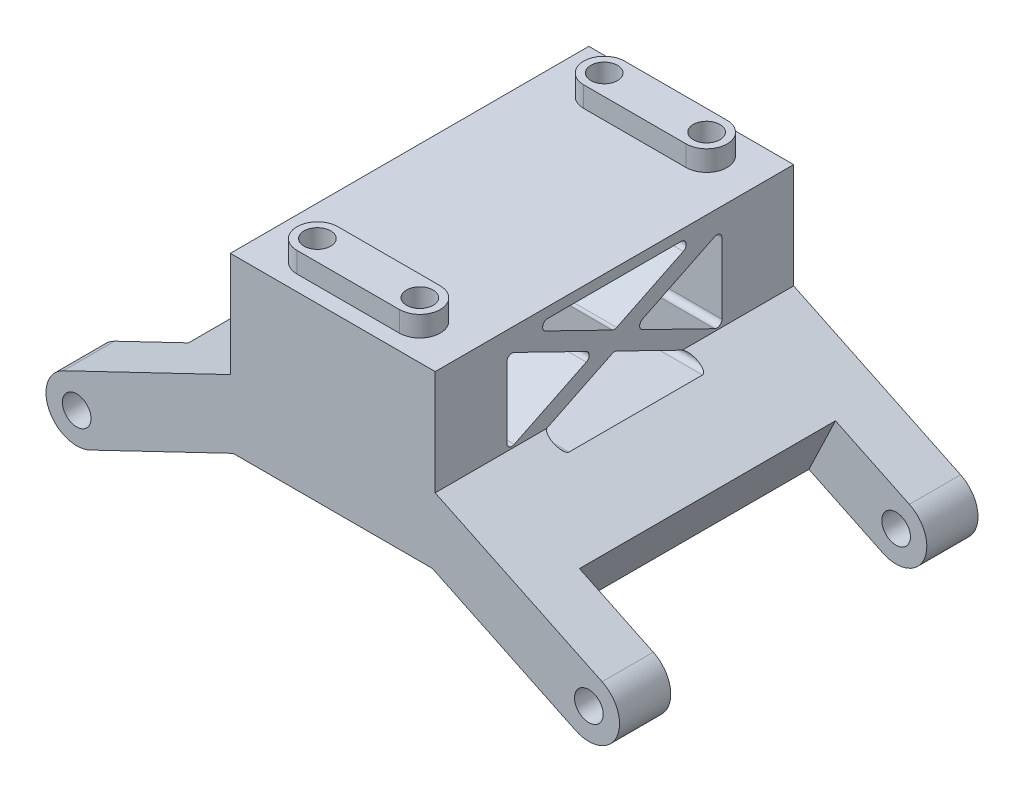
from build123d import *

# Parameters (mm, degrees)
BOSS_EXTRUDE1_DEPTH     = 22.225
SKETCH3_W               = 20.32
SKETCH3_H               = 31.75
CUT_EXTRUDE1_DEPTH      = 49.826270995
BOSS_EXTRUDE2_DEPTH     = 2.54
SKETCH5_R               = 1.651
CUT_EXTRUDE2_DEPTH      = 54.203468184
SKETCH6_R               = 1.778
CUT_EXTRUDE3_DEPTH      = 61.026815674
CUT_EXTRUDE4_DEPTH      = 47.058297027
CUT_EXTRUDE4_DEPTH_BACK = 47.058297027


with BuildPart() as part:
    # Sketch1 → Boss-Extrude1 (new, symmetric)
    with BuildSketch(Plane.XY):
        with BuildLine():
            Line((-30.101294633, -18.674802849), (-12.362122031, -10.16))
            Line((-12.362122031, -10.16), (12.362122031, -10.16))
            Line((12.362122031, -10.16), (30.101294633, -18.674802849))
            ThreePointArc((30.101294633, -18.674802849), (35.184802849, -16.888705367), (33.398705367, -11.805197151))
            Line((33.398705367, -11.805197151), (12.7, -1.869818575))
            Line((12.7, -1.869818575), (12.7, 11.153622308))
            Line((12.7, 11.153622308), (-12.7, 11.153622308))
            Line((-12.7, 11.153622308), (-12.7, -1.869818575))
            Line((-12.7, -1.869818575), (-33.398705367, -11.805197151))
            ThreePointArc((-33.398705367, -11.805197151), (-35.184802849, -16.888705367), (-30.101294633, -18.674802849))
        make_face()
    extrude(amount=BOSS_EXTRUDE1_DEPTH, both=True)

    # Sketch3 → Cut-Extrude1 (cut, through all)
    with BuildSketch(Plane(origin=(-1.648705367, 3.434802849, 0), x_dir=(0.9015230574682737, 0.4327310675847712, 0), z_dir=(-0.43273106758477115, 0.9015230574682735, 0))):
        with Locations((-35.218178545, 0)):
            Rectangle(SKETCH3_W, SKETCH3_H)
    cut_extrude1 = extrude(amount=-CUT_EXTRUDE1_DEPTH, mode=Mode.SUBTRACT)

    # Mirror1: Cut-Extrude1 across plane
    add(cut_extrude1.mirror(Plane(origin=(0, 0, 0), x_dir=(0, 0, 1), z_dir=(1, 0, 0))), mode=Mode.SUBTRACT)

    # Sketch4 → Boss-Extrude2 (add)
    with BuildSketch(Plane(origin=(0, 11.153622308, 0), x_dir=(1, 0, 0), z_dir=(0, 1, 0))):
        with BuildLine():
            Line((-6.35, 20.32), (6.35, 20.32))
            ThreePointArc((6.35, 20.32), (8.89, 17.78), (6.35, 15.24))
            Line((6.35, 15.24), (-6.35, 15.24))
            ThreePointArc((-6.35, 15.24), (-8.89, 17.78), (-6.35, 20.32))
        make_face()
        with BuildLine():
            Line((-6.35, -15.24), (6.35, -15.24))
            ThreePointArc((6.35, -15.24), (8.89, -17.78), (6.35, -20.32))
            Line((6.35, -20.32), (-6.35, -20.32))
            ThreePointArc((-6.35, -20.32), (-8.89, -17.78), (-6.35, -15.24))
        make_face()
    extrude(amount=BOSS_EXTRUDE2_DEPTH)

    # Sketch5 → Cut-Extrude2 (cut, through all)
    with BuildSketch(Plane(origin=(0, 13.693622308, 0), x_dir=(1, 0, 0), z_dir=(0, 1, 0))):
        with Locations(Location((-6.35, 17.78, 0), (0, 0, 180))):
            Circle(SKETCH5_R)
        with Locations(Location((6.35, 17.78, 0), (0, 0, 180))):
            Circle(SKETCH5_R)
        with Locations(Location((6.35, -17.78, 0), (0, 0, 180))):
            Circle(SKETCH5_R)
        with Locations(Location((-6.35, -17.78, 0), (0, 0, 180))):
            Circle(SKETCH5_R)
    extrude(amount=-CUT_EXTRUDE2_DEPTH, mode=Mode.SUBTRACT)

    # Sketch6 → Cut-Extrude3 (cut, through all)
    with BuildSketch(Plane.XY.offset(22.225)):
        with Locations((-31.75, -15.24)):
            Circle(SKETCH6_R)
        with Locations((31.75, -15.24)):
            Circle(SKETCH6_R)
    extrude(amount=-CUT_EXTRUDE3_DEPTH, mode=Mode.SUBTRACT)

    # Sketch8 → Cut-Extrude4 (cut, two sides: drawn at the far end of the back side and taken through both)
    with BuildSketch(Plane(origin=(0, 0, 0), x_dir=(0, 0, -1), z_dir=(1, 0, 0)).offset(-CUT_EXTRUDE4_DEPTH_BACK)):
        with BuildLine():
            Line((-8.550685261, -1.93421603), (-0.27863549, 2.105174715))
            ThreePointArc((-0.27863549, 2.105174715), (0, 2.16957217), (0.27863549, 2.105174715))
            Line((0.27863549, 2.105174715), (8.550685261, -1.93421603))
            ThreePointArc((8.550685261, -1.93421603), (8.890740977, -2.647808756), (8.272049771, -3.139818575))
            Line((8.272049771, -3.139818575), (-8.272049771, -3.139818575))
            ThreePointArc((-8.272049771, -3.139818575), (-8.890740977, -2.647808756), (-8.550685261, -1.93421603))
        make_face()
        with BuildLine():
            Line((-12.42136451, -1.563009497), (-3.483932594, 2.801299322))
            ThreePointArc((-3.483932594, 2.801299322), (-3.127568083, 3.371901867), (-3.483932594, 3.942504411))
            Line((-3.483932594, 3.942504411), (-12.42136451, 8.306813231))
            ThreePointArc((-12.42136451, 8.306813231), (-13.03637142, 8.27480076), (-13.335, 7.736210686))
            Line((-13.335, 7.736210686), (-13.335, -0.992406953))
            ThreePointArc((-13.335, -0.992406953), (-13.03637142, -1.530997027), (-12.42136451, -1.563009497))
        make_face()
        with BuildLine():
            Line((-8.550685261, 8.678019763), (-0.27863549, 4.638629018))
            ThreePointArc((-0.27863549, 4.638629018), (0, 4.574231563), (0.27863549, 4.638629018))
            Line((0.27863549, 4.638629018), (8.550685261, 8.678019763))
            ThreePointArc((8.550685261, 8.678019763), (8.890740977, 9.39161249), (8.272049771, 9.883622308))
            Line((8.272049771, 9.883622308), (-8.272049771, 9.883622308))
            ThreePointArc((-8.272049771, 9.883622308), (-8.890740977, 9.39161249), (-8.550685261, 8.678019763))
        make_face()
        with BuildLine():
            Line((13.335, 7.736210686), (13.335, -0.992406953))
            ThreePointArc((13.335, -0.992406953), (13.03637142, -1.530997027), (12.42136451, -1.563009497))
            Line((12.42136451, -1.563009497), (3.483932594, 2.801299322))
            ThreePointArc((3.483932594, 2.801299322), (3.127568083, 3.371901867), (3.483932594, 3.942504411))
            Line((3.483932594, 3.942504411), (12.42136451, 8.306813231))
            ThreePointArc((12.42136451, 8.306813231), (13.03637142, 8.27480076), (13.335, 7.736210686))
        make_face()
    extrude(amount=CUT_EXTRUDE4_DEPTH + CUT_EXTRUDE4_DEPTH_BACK, mode=Mode.SUBTRACT)


solid = part.part
